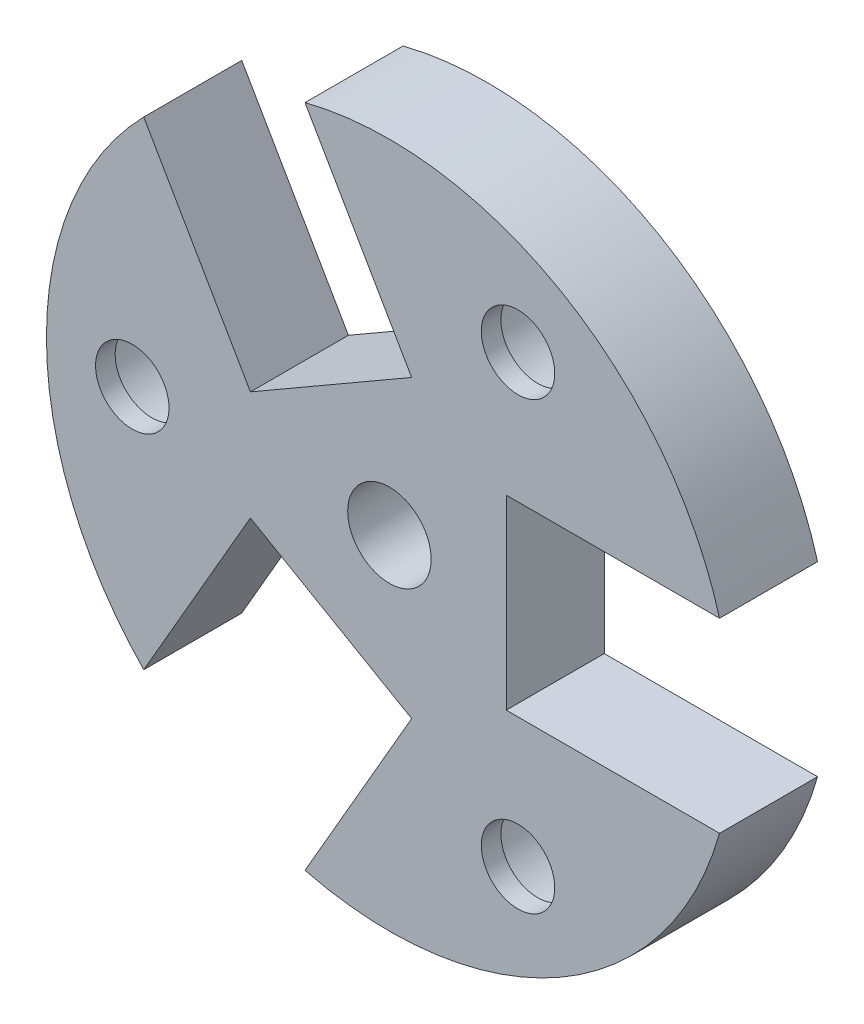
ISO-10303-21;
HEADER;
FILE_DESCRIPTION(('STEP AP214'),'2;1');
FILE_NAME('part.step','',(''),(''),'','','');
FILE_SCHEMA(('AUTOMOTIVE_DESIGN { 1 0 10303 214 1 1 1 1 }'));
ENDSEC;
DATA;
#1=APPLICATION_CONTEXT('core data for automotive mechanical design processes');
#2=APPLICATION_PROTOCOL_DEFINITION('international standard','automotive_design',2000,#1);
#3=PRODUCT_CONTEXT('',#1,'mechanical');
#4=PRODUCT('Part','Part','',(#3));
#5=PRODUCT_RELATED_PRODUCT_CATEGORY('part','',(#4));
#6=PRODUCT_DEFINITION_FORMATION('','',#4);
#7=PRODUCT_DEFINITION_CONTEXT('part definition',#1,'design');
#8=PRODUCT_DEFINITION('design','',#6,#7);
#9=PRODUCT_DEFINITION_SHAPE('','',#8);
#10=(LENGTH_UNIT() NAMED_UNIT(*) SI_UNIT(.MILLI.,.METRE.));
#11=(NAMED_UNIT(*) PLANE_ANGLE_UNIT() SI_UNIT($,.RADIAN.));
#12=(NAMED_UNIT(*) SI_UNIT($,.STERADIAN.) SOLID_ANGLE_UNIT());
#13=UNCERTAINTY_MEASURE_WITH_UNIT(LENGTH_MEASURE(1.E-05),#10,'distance_accuracy_value','');
#14=(GEOMETRIC_REPRESENTATION_CONTEXT(3) GLOBAL_UNCERTAINTY_ASSIGNED_CONTEXT((#13)) GLOBAL_UNIT_ASSIGNED_CONTEXT((#10,
#11,#12)) REPRESENTATION_CONTEXT('',''));
#15=CARTESIAN_POINT('',(0.,0.,0.));
#16=DIRECTION('',(0.,0.,1.));
#17=DIRECTION('',(1.,0.,0.));
#18=AXIS2_PLACEMENT_3D('',#15,#16,#17);
#19=CARTESIAN_POINT('',(8.33119999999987,14.4300616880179,0.));
#20=DIRECTION('',(0.,0.,-1.));
#21=DIRECTION('',(-1.,0.,0.));
#22=AXIS2_PLACEMENT_3D('',#19,#20,#21);
#23=CYLINDRICAL_SURFACE('',#22,2.38125);
#24=CARTESIAN_POINT('',(8.33119999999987,14.4300616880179,0.));
#25=DIRECTION('',(0.,0.,-1.));
#26=DIRECTION('',(0.499999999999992,0.866025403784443,0.));
#27=AXIS2_PLACEMENT_3D('',#24,#25,#26);
#28=CIRCLE('',#27,2.38125);
#29=CARTESIAN_POINT('',(9.52182499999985,16.4922846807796,0.));
#30=VERTEX_POINT('',#29);
#31=EDGE_CURVE('E223',#30,#30,#28,.T.);
#32=ORIENTED_EDGE('',*,*,#31,.F.);
#33=EDGE_LOOP('',(#32));
#34=FACE_BOUND('',#33,.T.);
#35=CARTESIAN_POINT('',(8.33119999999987,14.4300616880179,-1.27));
#36=DIRECTION('',(0.,0.,-1.));
#37=DIRECTION('',(-1.,0.,0.));
#38=AXIS2_PLACEMENT_3D('',#35,#36,#37);
#39=CIRCLE('',#38,2.38125);
#40=CARTESIAN_POINT('',(5.94994999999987,14.4300616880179,-1.27));
#41=VERTEX_POINT('',#40);
#42=EDGE_CURVE('E39',#41,#41,#39,.F.);
#43=ORIENTED_EDGE('',*,*,#42,.F.);
#44=EDGE_LOOP('',(#43));
#45=FACE_BOUND('',#44,.T.);
#46=ADVANCED_FACE('F35',(#34,#45),#23,.F.);
#47=CARTESIAN_POINT('',(8.33120000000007,-14.4300616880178,0.));
#48=DIRECTION('',(0.,0.,-1.));
#49=DIRECTION('',(-1.,0.,0.));
#50=AXIS2_PLACEMENT_3D('',#47,#48,#49);
#51=CYLINDRICAL_SURFACE('',#50,2.38125);
#52=CARTESIAN_POINT('',(8.33120000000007,-14.4300616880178,0.));
#53=DIRECTION('',(0.,0.,-1.));
#54=DIRECTION('',(0.500000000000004,-0.866025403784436,0.));
#55=AXIS2_PLACEMENT_3D('',#52,#53,#54);
#56=CIRCLE('',#55,2.38125);
#57=CARTESIAN_POINT('',(9.52182500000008,-16.4922846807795,0.));
#58=VERTEX_POINT('',#57);
#59=EDGE_CURVE('E228',#58,#58,#56,.T.);
#60=ORIENTED_EDGE('',*,*,#59,.F.);
#61=EDGE_LOOP('',(#60));
#62=FACE_BOUND('',#61,.T.);
#63=CARTESIAN_POINT('',(8.33120000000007,-14.4300616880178,-1.27));
#64=DIRECTION('',(0.,0.,-1.));
#65=DIRECTION('',(-1.,0.,0.));
#66=AXIS2_PLACEMENT_3D('',#63,#64,#65);
#67=CIRCLE('',#66,2.38125);
#68=CARTESIAN_POINT('',(5.94995000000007,-14.4300616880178,-1.27));
#69=VERTEX_POINT('',#68);
#70=EDGE_CURVE('E221',#69,#69,#67,.F.);
#71=ORIENTED_EDGE('',*,*,#70,.F.);
#72=EDGE_LOOP('',(#71));
#73=FACE_BOUND('',#72,.T.);
#74=ADVANCED_FACE('F267',(#62,#73),#51,.F.);
#75=CARTESIAN_POINT('',(-16.6624,0.,0.));
#76=DIRECTION('',(0.,0.,-1.));
#77=DIRECTION('',(-1.,0.,0.));
#78=AXIS2_PLACEMENT_3D('',#75,#76,#77);
#79=CYLINDRICAL_SURFACE('',#78,2.38125);
#80=CARTESIAN_POINT('',(-16.6624,0.,0.));
#81=DIRECTION('',(0.,0.,-1.));
#82=DIRECTION('',(-1.,0.,0.));
#83=AXIS2_PLACEMENT_3D('',#80,#81,#82);
#84=CIRCLE('',#83,2.38125);
#85=CARTESIAN_POINT('',(-19.04365,0.,0.));
#86=VERTEX_POINT('',#85);
#87=EDGE_CURVE('E151',#86,#86,#84,.T.);
#88=ORIENTED_EDGE('',*,*,#87,.F.);
#89=EDGE_LOOP('',(#88));
#90=FACE_BOUND('',#89,.T.);
#91=CARTESIAN_POINT('',(-16.6624,0.,-1.27));
#92=DIRECTION('',(0.,0.,-1.));
#93=DIRECTION('',(-1.,0.,0.));
#94=AXIS2_PLACEMENT_3D('',#91,#92,#93);
#95=CIRCLE('',#94,2.38125);
#96=CARTESIAN_POINT('',(-19.04365,0.,-1.27));
#97=VERTEX_POINT('',#96);
#98=EDGE_CURVE('E218',#97,#97,#95,.F.);
#99=ORIENTED_EDGE('',*,*,#98,.F.);
#100=EDGE_LOOP('',(#99));
#101=FACE_BOUND('',#100,.T.);
#102=ADVANCED_FACE('F273',(#90,#101),#79,.F.);
#103=CARTESIAN_POINT('',(0.,0.,-6.35));
#104=DIRECTION('',(0.,0.,1.));
#105=DIRECTION('',(1.,0.,0.));
#106=AXIS2_PLACEMENT_3D('',#103,#104,#105);
#107=CYLINDRICAL_SURFACE('',#106,22.225);
#108=DIRECTION('',(0.,0.,1.));
#109=VECTOR('',#108,1.);
#110=CARTESIAN_POINT('',(-5.47102279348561,-21.5410894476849,-6.35));
#111=LINE('',#110,#109);
#112=CARTESIAN_POINT('',(-5.47102279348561,-21.5410894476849,-6.35));
#113=VERTEX_POINT('',#112);
#114=CARTESIAN_POINT('',(-5.47102279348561,-21.5410894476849,0.));
#115=VERTEX_POINT('',#114);
#116=EDGE_CURVE('E158',#113,#115,#111,.T.);
#117=ORIENTED_EDGE('',*,*,#116,.F.);
#118=CARTESIAN_POINT('',(0.,0.,-6.35));
#119=DIRECTION('',(0.,0.,1.));
#120=DIRECTION('',(1.,0.,0.));
#121=AXIS2_PLACEMENT_3D('',#118,#119,#120);
#122=CIRCLE('',#121,22.225);
#123=CARTESIAN_POINT('',(21.3906420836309,-6.0325,-6.35));
#124=VERTEX_POINT('',#123);
#125=EDGE_CURVE('E211',#113,#124,#122,.T.);
#126=ORIENTED_EDGE('',*,*,#125,.T.);
#127=DIRECTION('',(0.,0.,1.));
#128=VECTOR('',#127,1.);
#129=CARTESIAN_POINT('',(21.3906420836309,-6.0325,-6.35));
#130=LINE('',#129,#128);
#131=CARTESIAN_POINT('',(21.3906420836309,-6.0325,0.));
#132=VERTEX_POINT('',#131);
#133=EDGE_CURVE('E198',#132,#124,#130,.F.);
#134=ORIENTED_EDGE('',*,*,#133,.F.);
#135=CARTESIAN_POINT('',(0.,0.,0.));
#136=DIRECTION('',(0.,0.,1.));
#137=DIRECTION('',(1.,0.,0.));
#138=AXIS2_PLACEMENT_3D('',#135,#136,#137);
#139=CIRCLE('',#138,22.225);
#140=EDGE_CURVE('E205',#115,#132,#139,.T.);
#141=ORIENTED_EDGE('',*,*,#140,.F.);
#142=EDGE_LOOP('',(#117,#126,#134,#141));
#143=FACE_BOUND('',#142,.T.);
#144=ADVANCED_FACE('F262',(#143),#107,.T.);
#145=DIRECTION('',(0.,0.,1.));
#146=VECTOR('',#145,1.);
#147=CARTESIAN_POINT('',(-15.9196192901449,-15.508589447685,-6.35));
#148=LINE('',#147,#146);
#149=CARTESIAN_POINT('',(-15.9196192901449,-15.508589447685,0.));
#150=VERTEX_POINT('',#149);
#151=CARTESIAN_POINT('',(-15.9196192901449,-15.508589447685,-6.35));
#152=VERTEX_POINT('',#151);
#153=EDGE_CURVE('E140',#150,#152,#148,.F.);
#154=ORIENTED_EDGE('',*,*,#153,.F.);
#155=CARTESIAN_POINT('',(-15.9196192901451,15.5085894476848,0.));
#156=VERTEX_POINT('',#155);
#157=EDGE_CURVE('E215',#156,#150,#139,.T.);
#158=ORIENTED_EDGE('',*,*,#157,.F.);
#159=DIRECTION('',(0.,0.,1.));
#160=VECTOR('',#159,1.);
#161=CARTESIAN_POINT('',(-15.9196192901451,15.5085894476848,-6.35));
#162=LINE('',#161,#160);
#163=CARTESIAN_POINT('',(-15.9196192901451,15.5085894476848,-6.35));
#164=VERTEX_POINT('',#163);
#165=EDGE_CURVE('E178',#164,#156,#162,.T.);
#166=ORIENTED_EDGE('',*,*,#165,.F.);
#167=EDGE_CURVE('E210',#164,#152,#122,.T.);
#168=ORIENTED_EDGE('',*,*,#167,.T.);
#169=EDGE_LOOP('',(#154,#158,#166,#168));
#170=FACE_BOUND('',#169,.T.);
#171=ADVANCED_FACE('F260',(#170),#107,.T.);
#172=DIRECTION('',(0.,0.,1.));
#173=VECTOR('',#172,1.);
#174=CARTESIAN_POINT('',(-5.47102279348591,21.5410894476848,-6.35));
#175=LINE('',#174,#173);
#176=CARTESIAN_POINT('',(-5.47102279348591,21.5410894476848,0.));
#177=VERTEX_POINT('',#176);
#178=CARTESIAN_POINT('',(-5.47102279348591,21.5410894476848,-6.35));
#179=VERTEX_POINT('',#178);
#180=EDGE_CURVE('E175',#177,#179,#175,.F.);
#181=ORIENTED_EDGE('',*,*,#180,.F.);
#182=CARTESIAN_POINT('',(21.3906420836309,6.0325,0.));
#183=VERTEX_POINT('',#182);
#184=EDGE_CURVE('E212',#183,#177,#139,.T.);
#185=ORIENTED_EDGE('',*,*,#184,.F.);
#186=DIRECTION('',(0.,0.,1.));
#187=VECTOR('',#186,1.);
#188=CARTESIAN_POINT('',(21.3906420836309,6.0325,-6.35));
#189=LINE('',#188,#187);
#190=CARTESIAN_POINT('',(21.3906420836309,6.0325,-6.35));
#191=VERTEX_POINT('',#190);
#192=EDGE_CURVE('E203',#191,#183,#189,.T.);
#193=ORIENTED_EDGE('',*,*,#192,.F.);
#194=EDGE_CURVE('E206',#191,#179,#122,.T.);
#195=ORIENTED_EDGE('',*,*,#194,.T.);
#196=EDGE_LOOP('',(#181,#185,#193,#195));
#197=FACE_BOUND('',#196,.T.);
#198=ADVANCED_FACE('F37',(#197),#107,.T.);
#199=CARTESIAN_POINT('',(0.,0.,-6.35));
#200=DIRECTION('',(0.,0.,1.));
#201=DIRECTION('',(1.,0.,0.));
#202=AXIS2_PLACEMENT_3D('',#199,#200,#201);
#203=PLANE('',#202);
#204=CARTESIAN_POINT('',(0.,0.,-6.35));
#205=DIRECTION('',(0.,0.,-1.));
#206=DIRECTION('',(-1.,0.,0.));
#207=AXIS2_PLACEMENT_3D('',#204,#205,#206);
#208=CIRCLE('',#207,2.70509999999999);
#209=CARTESIAN_POINT('',(-2.70509999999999,0.,-6.35));
#210=VERTEX_POINT('',#209);
#211=EDGE_CURVE('E498',#210,#210,#208,.T.);
#212=ORIENTED_EDGE('',*,*,#211,.F.);
#213=EDGE_LOOP('',(#212));
#214=FACE_BOUND('',#213,.T.);
#215=CARTESIAN_POINT('',(8.33119999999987,14.4300616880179,-6.35));
#216=DIRECTION('',(0.,0.,-1.));
#217=DIRECTION('',(0.499999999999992,0.866025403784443,0.));
#218=AXIS2_PLACEMENT_3D('',#215,#216,#217);
#219=CIRCLE('',#218,3.96875);
#220=CARTESIAN_POINT('',(10.3155749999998,17.8671000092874,-6.35));
#221=VERTEX_POINT('',#220);
#222=EDGE_CURVE('E238',#221,#221,#219,.T.);
#223=ORIENTED_EDGE('',*,*,#222,.F.);
#224=EDGE_LOOP('',(#223));
#225=FACE_BOUND('',#224,.T.);
#226=CARTESIAN_POINT('',(8.33120000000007,-14.4300616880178,-6.35));
#227=DIRECTION('',(0.,0.,-1.));
#228=DIRECTION('',(0.500000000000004,-0.866025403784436,0.));
#229=AXIS2_PLACEMENT_3D('',#226,#227,#228);
#230=CIRCLE('',#229,3.96875);
#231=CARTESIAN_POINT('',(10.3155750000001,-17.8671000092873,-6.35));
#232=VERTEX_POINT('',#231);
#233=EDGE_CURVE('E231',#232,#232,#230,.T.);
#234=ORIENTED_EDGE('',*,*,#233,.F.);
#235=EDGE_LOOP('',(#234));
#236=FACE_BOUND('',#235,.T.);
#237=CARTESIAN_POINT('',(-16.6624,0.,-6.35));
#238=DIRECTION('',(0.,0.,-1.));
#239=DIRECTION('',(-1.,0.,0.));
#240=AXIS2_PLACEMENT_3D('',#237,#238,#239);
#241=CIRCLE('',#240,3.96875);
#242=CARTESIAN_POINT('',(-20.63115,0.,-6.35));
#243=VERTEX_POINT('',#242);
#244=EDGE_CURVE('E243',#243,#243,#241,.T.);
#245=ORIENTED_EDGE('',*,*,#244,.F.);
#246=EDGE_LOOP('',(#245));
#247=FACE_BOUND('',#246,.T.);
#248=ORIENTED_EDGE('',*,*,#125,.F.);
#249=DIRECTION('',(0.499999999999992,0.866025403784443,0.));
#250=VECTOR('',#249,1.);
#251=CARTESIAN_POINT('',(1.43969824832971,-9.57136948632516,-6.35));
#252=LINE('',#251,#250);
#253=CARTESIAN_POINT('',(1.43969824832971,-9.57136948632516,-6.35));
#254=VERTEX_POINT('',#253);
#255=EDGE_CURVE('E134',#113,#254,#252,.T.);
#256=ORIENTED_EDGE('',*,*,#255,.T.);
#257=DIRECTION('',(-0.866025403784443,0.499999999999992,0.));
#258=VECTOR('',#257,1.);
#259=CARTESIAN_POINT('',(1.43969824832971,-9.57136948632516,-6.35));
#260=LINE('',#259,#258);
#261=CARTESIAN_POINT('',(-9.00889824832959,-3.53886948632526,-6.35));
#262=VERTEX_POINT('',#261);
#263=EDGE_CURVE('E129',#254,#262,#260,.T.);
#264=ORIENTED_EDGE('',*,*,#263,.T.);
#265=DIRECTION('',(-0.499999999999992,-0.866025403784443,0.));
#266=VECTOR('',#265,1.);
#267=CARTESIAN_POINT('',(-9.00889824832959,-3.53886948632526,-6.35));
#268=LINE('',#267,#266);
#269=EDGE_CURVE('E137',#262,#152,#268,.T.);
#270=ORIENTED_EDGE('',*,*,#269,.T.);
#271=ORIENTED_EDGE('',*,*,#167,.F.);
#272=DIRECTION('',(0.500000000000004,-0.866025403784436,0.));
#273=VECTOR('',#272,1.);
#274=CARTESIAN_POINT('',(-9.00889824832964,3.53886948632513,-6.35));
#275=LINE('',#274,#273);
#276=CARTESIAN_POINT('',(-9.00889824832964,3.53886948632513,-6.35));
#277=VERTEX_POINT('',#276);
#278=EDGE_CURVE('E167',#164,#277,#275,.T.);
#279=ORIENTED_EDGE('',*,*,#278,.T.);
#280=DIRECTION('',(0.866025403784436,0.500000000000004,0.));
#281=VECTOR('',#280,1.);
#282=CARTESIAN_POINT('',(-9.00889824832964,3.53886948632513,-6.35));
#283=LINE('',#282,#281);
#284=CARTESIAN_POINT('',(1.43969824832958,9.57136948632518,-6.35));
#285=VERTEX_POINT('',#284);
#286=EDGE_CURVE('E160',#277,#285,#283,.T.);
#287=ORIENTED_EDGE('',*,*,#286,.T.);
#288=DIRECTION('',(-0.500000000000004,0.866025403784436,0.));
#289=VECTOR('',#288,1.);
#290=CARTESIAN_POINT('',(1.43969824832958,9.57136948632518,-6.35));
#291=LINE('',#290,#289);
#292=EDGE_CURVE('E163',#285,#179,#291,.T.);
#293=ORIENTED_EDGE('',*,*,#292,.T.);
#294=ORIENTED_EDGE('',*,*,#194,.F.);
#295=DIRECTION('',(-1.,0.,0.));
#296=VECTOR('',#295,1.);
#297=CARTESIAN_POINT('',(7.5692,6.0325,-6.35));
#298=LINE('',#297,#296);
#299=CARTESIAN_POINT('',(7.5692,6.0325,-6.35));
#300=VERTEX_POINT('',#299);
#301=EDGE_CURVE('E188',#191,#300,#298,.T.);
#302=ORIENTED_EDGE('',*,*,#301,.T.);
#303=DIRECTION('',(0.,-1.,0.));
#304=VECTOR('',#303,1.);
#305=CARTESIAN_POINT('',(7.5692,6.0325,-6.35));
#306=LINE('',#305,#304);
#307=CARTESIAN_POINT('',(7.5692,-6.0325,-6.35));
#308=VERTEX_POINT('',#307);
#309=EDGE_CURVE('E181',#300,#308,#306,.T.);
#310=ORIENTED_EDGE('',*,*,#309,.T.);
#311=DIRECTION('',(1.,0.,0.));
#312=VECTOR('',#311,1.);
#313=CARTESIAN_POINT('',(7.5692,-6.0325,-6.35));
#314=LINE('',#313,#312);
#315=EDGE_CURVE('E184',#308,#124,#314,.T.);
#316=ORIENTED_EDGE('',*,*,#315,.T.);
#317=EDGE_LOOP('',(#248,#256,#264,#270,#271,#279,#287,#293,#294,#302,#310,#316));
#318=FACE_BOUND('',#317,.T.);
#319=ADVANCED_FACE('F146',(#214,#225,#236,#247,#318),#203,.F.);
#320=CARTESIAN_POINT('',(0.,0.,0.));
#321=DIRECTION('',(0.,0.,1.));
#322=DIRECTION('',(1.,0.,0.));
#323=AXIS2_PLACEMENT_3D('',#320,#321,#322);
#324=PLANE('',#323);
#325=CARTESIAN_POINT('',(0.,0.,0.));
#326=DIRECTION('',(0.,0.,-1.));
#327=DIRECTION('',(-1.,0.,0.));
#328=AXIS2_PLACEMENT_3D('',#325,#326,#327);
#329=CIRCLE('',#328,2.7051);
#330=CARTESIAN_POINT('',(-2.7051,0.,0.));
#331=VERTEX_POINT('',#330);
#332=EDGE_CURVE('E496',#331,#331,#329,.T.);
#333=ORIENTED_EDGE('',*,*,#332,.T.);
#334=EDGE_LOOP('',(#333));
#335=FACE_BOUND('',#334,.T.);
#336=ORIENTED_EDGE('',*,*,#31,.T.);
#337=EDGE_LOOP('',(#336));
#338=FACE_BOUND('',#337,.T.);
#339=ORIENTED_EDGE('',*,*,#59,.T.);
#340=EDGE_LOOP('',(#339));
#341=FACE_BOUND('',#340,.T.);
#342=ORIENTED_EDGE('',*,*,#87,.T.);
#343=EDGE_LOOP('',(#342));
#344=FACE_BOUND('',#343,.T.);
#345=DIRECTION('',(0.499999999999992,0.866025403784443,0.));
#346=VECTOR('',#345,1.);
#347=CARTESIAN_POINT('',(5.22429824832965,-3.01624999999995,0.));
#348=LINE('',#347,#346);
#349=CARTESIAN_POINT('',(1.43969824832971,-9.57136948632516,0.));
#350=VERTEX_POINT('',#349);
#351=EDGE_CURVE('E11',#115,#350,#348,.T.);
#352=ORIENTED_EDGE('',*,*,#351,.F.);
#353=ORIENTED_EDGE('',*,*,#140,.T.);
#354=DIRECTION('',(1.,0.,0.));
#355=VECTOR('',#354,1.);
#356=CARTESIAN_POINT('',(7.5692,-6.0325,0.));
#357=LINE('',#356,#355);
#358=CARTESIAN_POINT('',(7.5692,-6.0325,0.));
#359=VERTEX_POINT('',#358);
#360=EDGE_CURVE('E185',#359,#132,#357,.T.);
#361=ORIENTED_EDGE('',*,*,#360,.F.);
#362=DIRECTION('',(0.,-1.,0.));
#363=VECTOR('',#362,1.);
#364=CARTESIAN_POINT('',(7.5692,6.0325,0.));
#365=LINE('',#364,#363);
#366=CARTESIAN_POINT('',(7.5692,6.0325,0.));
#367=VERTEX_POINT('',#366);
#368=EDGE_CURVE('E180',#367,#359,#365,.T.);
#369=ORIENTED_EDGE('',*,*,#368,.F.);
#370=DIRECTION('',(-1.,0.,0.));
#371=VECTOR('',#370,1.);
#372=CARTESIAN_POINT('',(0.,6.0325,0.));
#373=LINE('',#372,#371);
#374=EDGE_CURVE('E209',#183,#367,#373,.T.);
#375=ORIENTED_EDGE('',*,*,#374,.F.);
#376=ORIENTED_EDGE('',*,*,#184,.T.);
#377=DIRECTION('',(-0.500000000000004,0.866025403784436,0.));
#378=VECTOR('',#377,1.);
#379=CARTESIAN_POINT('',(1.43969824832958,9.57136948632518,0.));
#380=LINE('',#379,#378);
#381=CARTESIAN_POINT('',(1.43969824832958,9.57136948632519,0.));
#382=VERTEX_POINT('',#381);
#383=EDGE_CURVE('E164',#382,#177,#380,.T.);
#384=ORIENTED_EDGE('',*,*,#383,.F.);
#385=DIRECTION('',(0.866025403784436,0.500000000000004,0.));
#386=VECTOR('',#385,1.);
#387=CARTESIAN_POINT('',(-9.00889824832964,3.53886948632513,0.));
#388=LINE('',#387,#386);
#389=CARTESIAN_POINT('',(-9.00889824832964,3.53886948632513,0.));
#390=VERTEX_POINT('',#389);
#391=EDGE_CURVE('E60',#390,#382,#388,.T.);
#392=ORIENTED_EDGE('',*,*,#391,.F.);
#393=DIRECTION('',(0.500000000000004,-0.866025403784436,0.));
#394=VECTOR('',#393,1.);
#395=CARTESIAN_POINT('',(-5.22429824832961,-3.01625000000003,0.));
#396=LINE('',#395,#394);
#397=EDGE_CURVE('E44',#156,#390,#396,.T.);
#398=ORIENTED_EDGE('',*,*,#397,.F.);
#399=ORIENTED_EDGE('',*,*,#157,.T.);
#400=DIRECTION('',(-0.499999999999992,-0.866025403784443,0.));
#401=VECTOR('',#400,1.);
#402=CARTESIAN_POINT('',(-9.00889824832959,-3.53886948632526,0.));
#403=LINE('',#402,#401);
#404=CARTESIAN_POINT('',(-9.00889824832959,-3.53886948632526,0.));
#405=VERTEX_POINT('',#404);
#406=EDGE_CURVE('E147',#405,#150,#403,.T.);
#407=ORIENTED_EDGE('',*,*,#406,.F.);
#408=DIRECTION('',(-0.866025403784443,0.499999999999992,0.));
#409=VECTOR('',#408,1.);
#410=CARTESIAN_POINT('',(1.43969824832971,-9.57136948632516,0.));
#411=LINE('',#410,#409);
#412=EDGE_CURVE('E52',#350,#405,#411,.T.);
#413=ORIENTED_EDGE('',*,*,#412,.F.);
#414=EDGE_LOOP('',(#352,#353,#361,#369,#375,#376,#384,#392,#398,#399,#407,#413));
#415=FACE_BOUND('',#414,.T.);
#416=ADVANCED_FACE('F251',(#335,#338,#341,#344,#415),#324,.T.);
#417=CARTESIAN_POINT('',(7.5692,6.0325,-6.35));
#418=DIRECTION('',(-1.,0.,0.));
#419=DIRECTION('',(0.,-1.,0.));
#420=AXIS2_PLACEMENT_3D('',#417,#418,#419);
#421=PLANE('',#420);
#422=ORIENTED_EDGE('',*,*,#368,.T.);
#423=DIRECTION('',(0.,0.,1.));
#424=VECTOR('',#423,1.);
#425=CARTESIAN_POINT('',(7.5692,-6.0325,-6.35));
#426=LINE('',#425,#424);
#427=EDGE_CURVE('E191',#308,#359,#426,.T.);
#428=ORIENTED_EDGE('',*,*,#427,.F.);
#429=ORIENTED_EDGE('',*,*,#309,.F.);
#430=DIRECTION('',(0.,0.,1.));
#431=VECTOR('',#430,1.);
#432=CARTESIAN_POINT('',(7.5692,6.0325,-6.35));
#433=LINE('',#432,#431);
#434=EDGE_CURVE('E195',#300,#367,#433,.T.);
#435=ORIENTED_EDGE('',*,*,#434,.T.);
#436=EDGE_LOOP('',(#422,#428,#429,#435));
#437=FACE_BOUND('',#436,.T.);
#438=ADVANCED_FACE('F258',(#437),#421,.F.);
#439=CARTESIAN_POINT('',(7.5692,6.0325,-6.35));
#440=DIRECTION('',(0.,1.,0.));
#441=DIRECTION('',(0.,0.,1.));
#442=AXIS2_PLACEMENT_3D('',#439,#440,#441);
#443=PLANE('',#442);
#444=ORIENTED_EDGE('',*,*,#192,.T.);
#445=ORIENTED_EDGE('',*,*,#374,.T.);
#446=ORIENTED_EDGE('',*,*,#434,.F.);
#447=ORIENTED_EDGE('',*,*,#301,.F.);
#448=EDGE_LOOP('',(#444,#445,#446,#447));
#449=FACE_BOUND('',#448,.T.);
#450=ADVANCED_FACE('F313',(#449),#443,.F.);
#451=CARTESIAN_POINT('',(7.5692,-6.0325,-6.35));
#452=DIRECTION('',(0.,-1.,0.));
#453=DIRECTION('',(0.,0.,-1.));
#454=AXIS2_PLACEMENT_3D('',#451,#452,#453);
#455=PLANE('',#454);
#456=ORIENTED_EDGE('',*,*,#133,.T.);
#457=ORIENTED_EDGE('',*,*,#315,.F.);
#458=ORIENTED_EDGE('',*,*,#427,.T.);
#459=ORIENTED_EDGE('',*,*,#360,.T.);
#460=EDGE_LOOP('',(#456,#457,#458,#459));
#461=FACE_BOUND('',#460,.T.);
#462=ADVANCED_FACE('F312',(#461),#455,.F.);
#463=CARTESIAN_POINT('',(-9.00889824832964,3.53886948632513,-6.35));
#464=DIRECTION('',(0.500000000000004,-0.866025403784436,0.));
#465=DIRECTION('',(0.866025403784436,0.500000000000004,0.));
#466=AXIS2_PLACEMENT_3D('',#463,#464,#465);
#467=PLANE('',#466);
#468=ORIENTED_EDGE('',*,*,#391,.T.);
#469=DIRECTION('',(0.,0.,1.));
#470=VECTOR('',#469,1.);
#471=CARTESIAN_POINT('',(1.43969824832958,9.57136948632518,-6.35));
#472=LINE('',#471,#470);
#473=EDGE_CURVE('E170',#285,#382,#472,.T.);
#474=ORIENTED_EDGE('',*,*,#473,.F.);
#475=ORIENTED_EDGE('',*,*,#286,.F.);
#476=DIRECTION('',(0.,0.,1.));
#477=VECTOR('',#476,1.);
#478=CARTESIAN_POINT('',(-9.00889824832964,3.53886948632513,-6.35));
#479=LINE('',#478,#477);
#480=EDGE_CURVE('E173',#277,#390,#479,.T.);
#481=ORIENTED_EDGE('',*,*,#480,.T.);
#482=EDGE_LOOP('',(#468,#474,#475,#481));
#483=FACE_BOUND('',#482,.T.);
#484=ADVANCED_FACE('F305',(#483),#467,.F.);
#485=CARTESIAN_POINT('',(-9.00889824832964,3.53886948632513,-6.35));
#486=DIRECTION('',(-0.866025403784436,-0.500000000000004,0.));
#487=DIRECTION('',(0.500000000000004,-0.866025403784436,0.));
#488=AXIS2_PLACEMENT_3D('',#485,#486,#487);
#489=PLANE('',#488);
#490=ORIENTED_EDGE('',*,*,#165,.T.);
#491=ORIENTED_EDGE('',*,*,#397,.T.);
#492=ORIENTED_EDGE('',*,*,#480,.F.);
#493=ORIENTED_EDGE('',*,*,#278,.F.);
#494=EDGE_LOOP('',(#490,#491,#492,#493));
#495=FACE_BOUND('',#494,.T.);
#496=ADVANCED_FACE('F302',(#495),#489,.F.);
#497=CARTESIAN_POINT('',(1.43969824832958,9.57136948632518,-6.35));
#498=DIRECTION('',(0.866025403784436,0.500000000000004,0.));
#499=DIRECTION('',(-0.500000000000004,0.866025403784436,0.));
#500=AXIS2_PLACEMENT_3D('',#497,#498,#499);
#501=PLANE('',#500);
#502=ORIENTED_EDGE('',*,*,#180,.T.);
#503=ORIENTED_EDGE('',*,*,#292,.F.);
#504=ORIENTED_EDGE('',*,*,#473,.T.);
#505=ORIENTED_EDGE('',*,*,#383,.T.);
#506=EDGE_LOOP('',(#502,#503,#504,#505));
#507=FACE_BOUND('',#506,.T.);
#508=ADVANCED_FACE('F301',(#507),#501,.F.);
#509=CARTESIAN_POINT('',(1.43969824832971,-9.57136948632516,-6.35));
#510=DIRECTION('',(0.499999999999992,0.866025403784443,0.));
#511=DIRECTION('',(-0.866025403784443,0.499999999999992,0.));
#512=AXIS2_PLACEMENT_3D('',#509,#510,#511);
#513=PLANE('',#512);
#514=ORIENTED_EDGE('',*,*,#412,.T.);
#515=DIRECTION('',(0.,0.,1.));
#516=VECTOR('',#515,1.);
#517=CARTESIAN_POINT('',(-9.00889824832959,-3.53886948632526,-6.35));
#518=LINE('',#517,#516);
#519=EDGE_CURVE('E125',#262,#405,#518,.T.);
#520=ORIENTED_EDGE('',*,*,#519,.F.);
#521=ORIENTED_EDGE('',*,*,#263,.F.);
#522=DIRECTION('',(0.,0.,1.));
#523=VECTOR('',#522,1.);
#524=CARTESIAN_POINT('',(1.43969824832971,-9.57136948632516,-6.35));
#525=LINE('',#524,#523);
#526=EDGE_CURVE('E133',#254,#350,#525,.T.);
#527=ORIENTED_EDGE('',*,*,#526,.T.);
#528=EDGE_LOOP('',(#514,#520,#521,#527));
#529=FACE_BOUND('',#528,.T.);
#530=ADVANCED_FACE('F127',(#529),#513,.F.);
#531=CARTESIAN_POINT('',(1.43969824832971,-9.57136948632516,-6.35));
#532=DIRECTION('',(0.866025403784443,-0.499999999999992,0.));
#533=DIRECTION('',(0.499999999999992,0.866025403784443,0.));
#534=AXIS2_PLACEMENT_3D('',#531,#532,#533);
#535=PLANE('',#534);
#536=ORIENTED_EDGE('',*,*,#116,.T.);
#537=ORIENTED_EDGE('',*,*,#351,.T.);
#538=ORIENTED_EDGE('',*,*,#526,.F.);
#539=ORIENTED_EDGE('',*,*,#255,.F.);
#540=EDGE_LOOP('',(#536,#537,#538,#539));
#541=FACE_BOUND('',#540,.T.);
#542=ADVANCED_FACE('F293',(#541),#535,.F.);
#543=CARTESIAN_POINT('',(-9.00889824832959,-3.53886948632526,-6.35));
#544=DIRECTION('',(-0.866025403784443,0.499999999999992,0.));
#545=DIRECTION('',(-0.499999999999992,-0.866025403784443,0.));
#546=AXIS2_PLACEMENT_3D('',#543,#544,#545);
#547=PLANE('',#546);
#548=ORIENTED_EDGE('',*,*,#153,.T.);
#549=ORIENTED_EDGE('',*,*,#269,.F.);
#550=ORIENTED_EDGE('',*,*,#519,.T.);
#551=ORIENTED_EDGE('',*,*,#406,.T.);
#552=EDGE_LOOP('',(#548,#549,#550,#551));
#553=FACE_BOUND('',#552,.T.);
#554=ADVANCED_FACE('F138',(#553),#547,.F.);
#555=CARTESIAN_POINT('',(-16.6624,0.,-1.27));
#556=DIRECTION('',(0.,0.,-1.));
#557=DIRECTION('',(-1.,0.,0.));
#558=AXIS2_PLACEMENT_3D('',#555,#556,#557);
#559=PLANE('',#558);
#560=CARTESIAN_POINT('',(-16.6624,0.,-1.27));
#561=DIRECTION('',(0.,0.,-1.));
#562=DIRECTION('',(-1.,0.,0.));
#563=AXIS2_PLACEMENT_3D('',#560,#561,#562);
#564=CIRCLE('',#563,3.96875);
#565=CARTESIAN_POINT('',(-20.63115,0.,-1.27));
#566=VERTEX_POINT('',#565);
#567=EDGE_CURVE('E220',#566,#566,#564,.T.);
#568=ORIENTED_EDGE('',*,*,#567,.T.);
#569=EDGE_LOOP('',(#568));
#570=FACE_BOUND('',#569,.T.);
#571=ORIENTED_EDGE('',*,*,#98,.T.);
#572=EDGE_LOOP('',(#571));
#573=FACE_BOUND('',#572,.T.);
#574=ADVANCED_FACE('F282',(#570,#573),#559,.T.);
#575=CARTESIAN_POINT('',(-16.6624,0.,-1.27));
#576=DIRECTION('',(0.,0.,-1.));
#577=DIRECTION('',(-1.,0.,0.));
#578=AXIS2_PLACEMENT_3D('',#575,#576,#577);
#579=CYLINDRICAL_SURFACE('',#578,3.96875);
#580=ORIENTED_EDGE('',*,*,#567,.F.);
#581=EDGE_LOOP('',(#580));
#582=FACE_BOUND('',#581,.T.);
#583=ORIENTED_EDGE('',*,*,#244,.T.);
#584=EDGE_LOOP('',(#583));
#585=FACE_BOUND('',#584,.T.);
#586=ADVANCED_FACE('F248',(#582,#585),#579,.F.);
#587=CARTESIAN_POINT('',(8.33120000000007,-14.4300616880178,-1.27));
#588=DIRECTION('',(0.,0.,-1.));
#589=DIRECTION('',(0.500000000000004,-0.866025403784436,0.));
#590=AXIS2_PLACEMENT_3D('',#587,#588,#589);
#591=PLANE('',#590);
#592=CARTESIAN_POINT('',(8.33120000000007,-14.4300616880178,-1.27));
#593=DIRECTION('',(0.,0.,-1.));
#594=DIRECTION('',(0.500000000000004,-0.866025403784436,0.));
#595=AXIS2_PLACEMENT_3D('',#592,#593,#594);
#596=CIRCLE('',#595,3.96875);
#597=CARTESIAN_POINT('',(10.3155750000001,-17.8671000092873,-1.27));
#598=VERTEX_POINT('',#597);
#599=EDGE_CURVE('E224',#598,#598,#596,.T.);
#600=ORIENTED_EDGE('',*,*,#599,.T.);
#601=EDGE_LOOP('',(#600));
#602=FACE_BOUND('',#601,.T.);
#603=ORIENTED_EDGE('',*,*,#70,.T.);
#604=EDGE_LOOP('',(#603));
#605=FACE_BOUND('',#604,.T.);
#606=ADVANCED_FACE('F288',(#602,#605),#591,.T.);
#607=CARTESIAN_POINT('',(8.33120000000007,-14.4300616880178,-1.27));
#608=DIRECTION('',(0.,0.,-1.));
#609=DIRECTION('',(-1.,0.,0.));
#610=AXIS2_PLACEMENT_3D('',#607,#608,#609);
#611=CYLINDRICAL_SURFACE('',#610,3.96875);
#612=ORIENTED_EDGE('',*,*,#599,.F.);
#613=EDGE_LOOP('',(#612));
#614=FACE_BOUND('',#613,.T.);
#615=ORIENTED_EDGE('',*,*,#233,.T.);
#616=EDGE_LOOP('',(#615));
#617=FACE_BOUND('',#616,.T.);
#618=ADVANCED_FACE('F279',(#614,#617),#611,.F.);
#619=CARTESIAN_POINT('',(8.33119999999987,14.4300616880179,-1.27));
#620=DIRECTION('',(0.,0.,-1.));
#621=DIRECTION('',(0.499999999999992,0.866025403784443,0.));
#622=AXIS2_PLACEMENT_3D('',#619,#620,#621);
#623=PLANE('',#622);
#624=CARTESIAN_POINT('',(8.33119999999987,14.4300616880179,-1.27));
#625=DIRECTION('',(0.,0.,-1.));
#626=DIRECTION('',(0.499999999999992,0.866025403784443,0.));
#627=AXIS2_PLACEMENT_3D('',#624,#625,#626);
#628=CIRCLE('',#627,3.96875);
#629=CARTESIAN_POINT('',(10.3155749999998,17.8671000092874,-1.27));
#630=VERTEX_POINT('',#629);
#631=EDGE_CURVE('E501',#630,#630,#628,.T.);
#632=ORIENTED_EDGE('',*,*,#631,.T.);
#633=EDGE_LOOP('',(#632));
#634=FACE_BOUND('',#633,.T.);
#635=ORIENTED_EDGE('',*,*,#42,.T.);
#636=EDGE_LOOP('',(#635));
#637=FACE_BOUND('',#636,.T.);
#638=ADVANCED_FACE('F438',(#634,#637),#623,.T.);
#639=CARTESIAN_POINT('',(8.33119999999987,14.4300616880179,-1.27));
#640=DIRECTION('',(0.,0.,-1.));
#641=DIRECTION('',(-1.,0.,0.));
#642=AXIS2_PLACEMENT_3D('',#639,#640,#641);
#643=CYLINDRICAL_SURFACE('',#642,3.96875);
#644=ORIENTED_EDGE('',*,*,#631,.F.);
#645=EDGE_LOOP('',(#644));
#646=FACE_BOUND('',#645,.T.);
#647=ORIENTED_EDGE('',*,*,#222,.T.);
#648=EDGE_LOOP('',(#647));
#649=FACE_BOUND('',#648,.T.);
#650=ADVANCED_FACE('F447',(#646,#649),#643,.F.);
#651=CARTESIAN_POINT('',(0.,0.,-6.35));
#652=DIRECTION('',(0.,0.,-1.));
#653=DIRECTION('',(-1.,0.,0.));
#654=AXIS2_PLACEMENT_3D('',#651,#652,#653);
#655=CYLINDRICAL_SURFACE('',#654,2.70509999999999);
#656=ORIENTED_EDGE('',*,*,#332,.F.);
#657=EDGE_LOOP('',(#656));
#658=FACE_BOUND('',#657,.T.);
#659=ORIENTED_EDGE('',*,*,#211,.T.);
#660=EDGE_LOOP('',(#659));
#661=FACE_BOUND('',#660,.T.);
#662=ADVANCED_FACE('F456',(#658,#661),#655,.F.);
#663=CLOSED_SHELL('',(#46,#74,#102,#144,#171,#198,#319,#416,#438,#450,#462,#484,#496,#508,#530,
#542,#554,#574,#586,#606,#618,#638,#650,#662));
#664=MANIFOLD_SOLID_BREP('B2',#663);
#665=ADVANCED_BREP_SHAPE_REPRESENTATION('',(#18,#664),#14);
#666=SHAPE_DEFINITION_REPRESENTATION(#9,#665);
ENDSEC;
END-ISO-10303-21;
